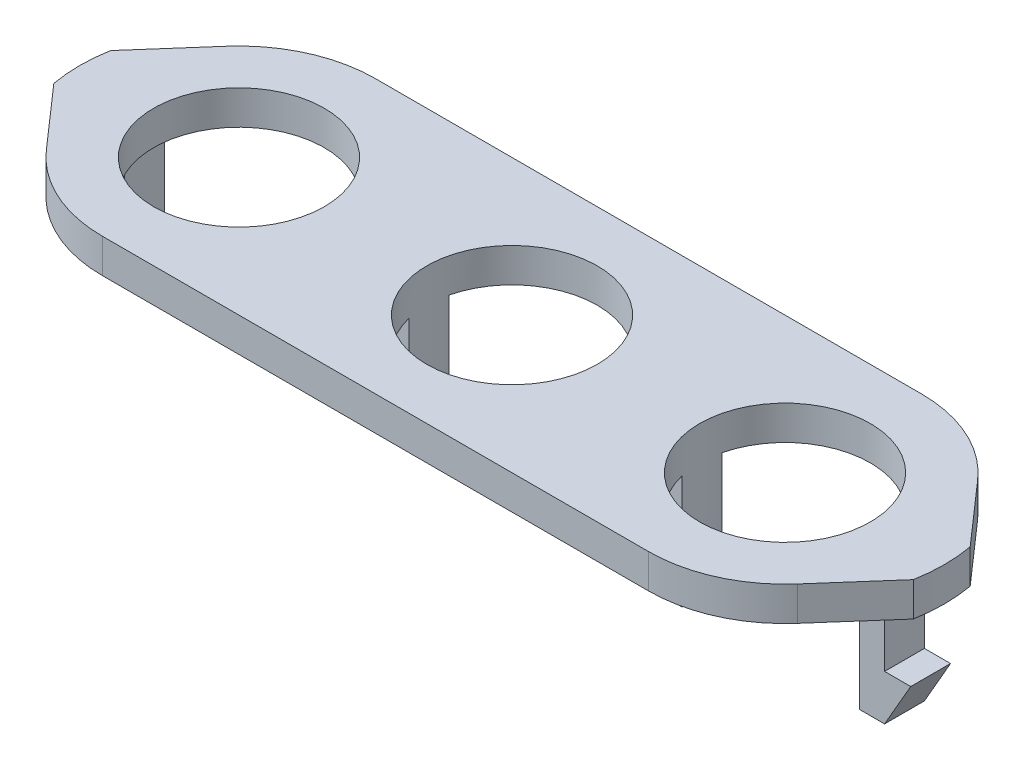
from build123d import *

# Parameters (mm, degrees)
SKETCH1_R           = 7.5
BOSS_EXTRUDE2_DEPTH = 3
BOSS_EXTRUDE4_START = 10
BOSS_EXTRUDE4_DEPTH = 10
BOSS_EXTRUDE5_DEPTH = 3.5
CUT_EXTRUDE1_DEPTH  = 10


with BuildPart() as part:
    # Sketch1 → Boss-Extrude2 (new body)
    # profile 1 of 5: a face of its own
    with BuildSketch(Plane(origin=(0, 0, 0), x_dir=(1, 0, 0), z_dir=(0, 1, 0))):
        with BuildLine():
            ThreePointArc((-33.01665131, 7.918333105), (-27.603960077, 11.446024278), (-21.146575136, 11.655812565))
            Line((-21.146575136, 11.655812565), (-12, 9.416666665))
            Line((-12, 9.416666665), (-2.853424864, 11.655812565))
            ThreePointArc((-2.853424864, 11.655812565), (0, 12), (2.853424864, 11.655812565))
            Line((2.853424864, 11.655812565), (12, 9.416666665))
            Line((12, 9.416666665), (21.146575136, 11.655812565))
            ThreePointArc((21.146575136, 11.655812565), (27.603960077, 11.446024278), (33.01665131, 7.918333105))
            Line((33.01665131, 7.918333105), (37.774977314, 2.5))
            ThreePointArc((37.774977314, 2.5), (38, 0), (37.774977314, -2.5))
            Line((37.774977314, -2.5), (33.01665131, -7.918333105))
            ThreePointArc((33.01665131, -7.918333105), (27.603960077, -11.446024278), (21.146575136, -11.655812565))
            Line((21.146575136, -11.655812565), (12, -9.416666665))
            Line((12, -9.416666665), (2.853424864, -11.655812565))
            ThreePointArc((2.853424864, -11.655812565), (0, -12), (-2.853424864, -11.655812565))
            Line((-2.853424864, -11.655812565), (-12, -9.416666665))
            Line((-12, -9.416666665), (-21.146575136, -11.655812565))
            ThreePointArc((-21.146575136, -11.655812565), (-27.603960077, -11.446024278), (-33.01665131, -7.918333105))
            Line((-33.01665131, -7.918333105), (-37.774977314, -2.5))
            ThreePointArc((-37.774977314, -2.5), (-38, 0), (-37.774977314, 2.5))
            Line((-37.774977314, 2.5), (-33.01665131, 7.918333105))
        make_face()
        with Locations(Location((0, 0, 0), (0, 0, 270))):
            Circle(SKETCH1_R, mode=Mode.SUBTRACT)
        with Locations(Location((-24, 0, 0), (0, 0, 270))):
            Circle(SKETCH1_R, mode=Mode.SUBTRACT)
        with Locations(Location((24, 0, 0), (0, 0, 270))):
            Circle(SKETCH1_R, mode=Mode.SUBTRACT)
    # profile 2 of 5: a face of its own
    with BuildSketch(Plane(origin=(0, 0, 0), x_dir=(1, 0, 0), z_dir=(0, 1, 0))):
        with BuildLine():
            Line((-24, -12), (-6.1e-08, -12))
            ThreePointArc((-6.1e-08, -12), (-1.437054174, -11.913642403), (-2.853424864, -11.655812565))
            Line((-2.853424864, -11.655812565), (-12, -9.416666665))
            Line((-12, -9.416666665), (-21.146575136, -11.655812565))
            ThreePointArc((-21.146575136, -11.655812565), (-22.562945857, -11.913642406), (-24, -12))
        make_face()
    # profile 3 of 5: a face of its own
    with BuildSketch(Plane(origin=(0, 0, 0), x_dir=(1, 0, 0), z_dir=(0, 1, 0))):
        with BuildLine():
            Line((-6.1e-08, -12), (24, -12))
            ThreePointArc((24, -12), (22.562945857, -11.913642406), (21.146575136, -11.655812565))
            Line((21.146575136, -11.655812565), (12, -9.416666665))
            Line((12, -9.416666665), (2.853424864, -11.655812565))
            ThreePointArc((2.853424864, -11.655812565), (1.437054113, -11.91364241), (-6.1e-08, -12))
        make_face()
    # profile 4 of 5: a face of its own
    with BuildSketch(Plane(origin=(0, 0, 0), x_dir=(1, 0, 0), z_dir=(0, 1, 0))):
        with BuildLine():
            ThreePointArc((21.146575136, 11.655812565), (22.562945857, 11.913642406), (24, 12))
            Line((24, 12), (-7e-09, 12))
            ThreePointArc((-7e-09, 12), (1.43705414, 11.913642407), (2.853424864, 11.655812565))
            Line((2.853424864, 11.655812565), (12, 9.416666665))
            Line((12, 9.416666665), (21.146575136, 11.655812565))
        make_face()
    # profile 5 of 5: a face of its own
    with BuildSketch(Plane(origin=(0, 0, 0), x_dir=(1, 0, 0), z_dir=(0, 1, 0))):
        with BuildLine():
            ThreePointArc((-2.853424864, 11.655812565), (-1.437054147, 11.913642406), (-7e-09, 12))
            Line((-7e-09, 12), (-24, 12))
            ThreePointArc((-24, 12), (-22.562945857, 11.913642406), (-21.146575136, 11.655812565))
            Line((-21.146575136, 11.655812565), (-12, 9.416666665))
            Line((-12, 9.416666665), (-2.853424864, 11.655812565))
        make_face()
    extrude(amount=BOSS_EXTRUDE2_DEPTH)

    # Sketch2 → Boss-Extrude4 (add)
    with BuildSketch(Plane.XZ.offset(BOSS_EXTRUDE4_START)):
        with BuildLine():
            Line((16.707023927, 1.75), (7.292976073, 1.75))
            ThreePointArc((7.292976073, 1.75), (7.5, 0), (7.292976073, -1.75))
            Line((7.292976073, -1.75), (16.707023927, -1.75))
            ThreePointArc((16.707023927, -1.75), (16.5, 0), (16.707023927, 1.75))
        make_face()
        with BuildLine():
            Line((-34.5, 1.75), (-34.5, 0))
            Line((-34.5, 0), (-34.5, -1.75))
            Line((-34.5, -1.75), (-31.292976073, -1.75))
            ThreePointArc((-31.292976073, -1.75), (-31.5, 0), (-31.292976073, 1.75))
            Line((-31.292976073, 1.75), (-34.5, 1.75))
        make_face()
        with BuildLine():
            Line((-7.292976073, -1.75), (-16.707023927, -1.75))
            ThreePointArc((-16.707023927, -1.75), (-16.5, 0), (-16.707023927, 1.75))
            Line((-16.707023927, 1.75), (-7.292976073, 1.75))
            ThreePointArc((-7.292976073, 1.75), (-7.5, 0), (-7.292976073, -1.75))
        make_face()
        with BuildLine():
            Line((34.5, 1.75), (34.5, 0))
            Line((34.5, 0), (34.5, -1.75))
            Line((34.5, -1.75), (31.292976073, -1.75))
            ThreePointArc((31.292976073, -1.75), (31.5, 0), (31.292976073, 1.75))
            Line((31.292976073, 1.75), (34.5, 1.75))
        make_face()
    extrude(amount=-BOSS_EXTRUDE4_DEPTH)

    # Sketch4 → Boss-Extrude5 (add)
    with BuildSketch(Plane(origin=(0, 0, -1.75), x_dir=(-1, 0, 0), z_dir=(0, 0, -1))):
        Polygon((34.5, -10), (34.5, -6), (36.8, -6), align=None)
        Polygon((-34.5, -10), (-36.8, -6), (-34.5, -6), align=None)
    extrude(amount=-BOSS_EXTRUDE5_DEPTH)

    # Sketch5 → Cut-Extrude1 (cut)
    with BuildSketch(Plane.XZ.offset(10)):
        with BuildLine():
            ThreePointArc((-31.292976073, -1.75), (-31.5, 0), (-31.292976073, 1.75))
            Line((-31.292976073, 1.75), (-32.292976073, 1.75))
            Line((-32.292976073, 1.75), (-32.292976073, -1.75))
            Line((-32.292976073, -1.75), (-31.292976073, -1.75))
        make_face()
        with BuildLine():
            Line((32.292976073, 1.75), (32.292976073, -1.75))
            Line((32.292976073, -1.75), (31.292976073, -1.75))
            ThreePointArc((31.292976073, -1.75), (31.5, 0), (31.292976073, 1.75))
            Line((31.292976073, 1.75), (32.292976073, 1.75))
        make_face()
    extrude(amount=-CUT_EXTRUDE1_DEPTH, mode=Mode.SUBTRACT)


solid = part.part
